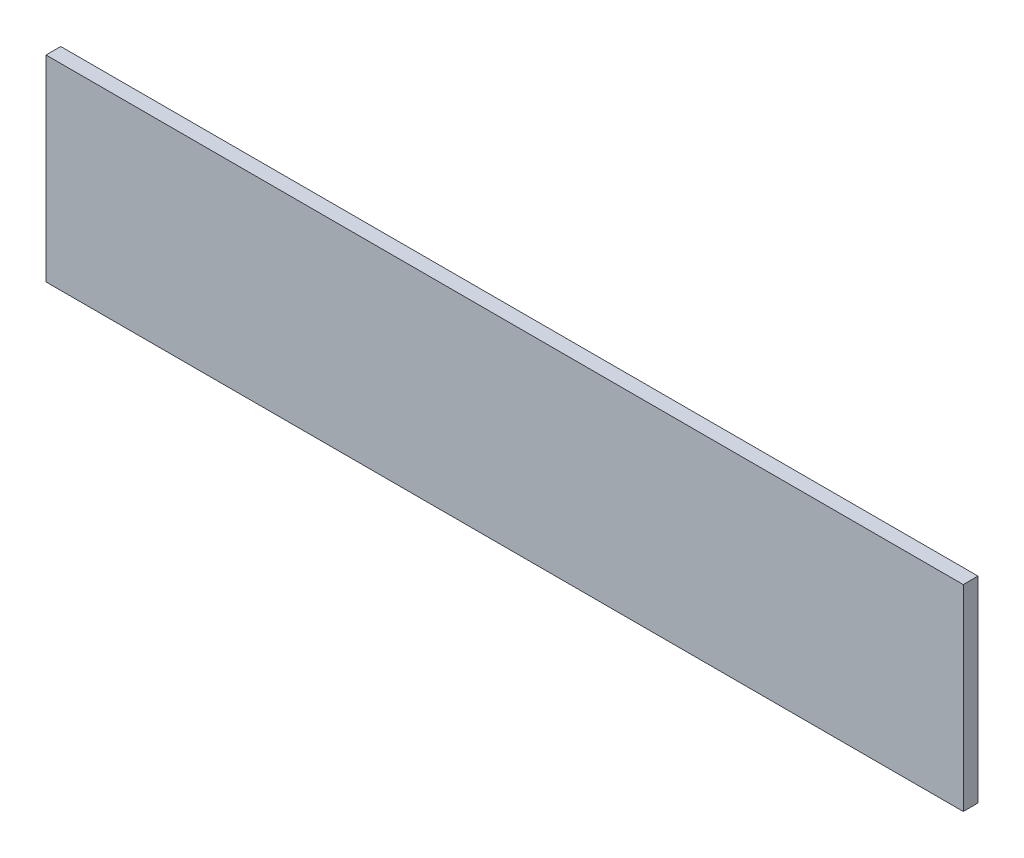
from build123d import *

# Parameters (mm, degrees)
SKETCH1_W           = 280
SKETCH1_H           = 60
BOSS_EXTRUDE1_DEPTH = 4.5


with BuildPart() as part:
    # Sketch1 → Boss-Extrude1 (new body)
    with BuildSketch(Plane.XY):
        Rectangle(SKETCH1_W, SKETCH1_H)
    extrude(amount=BOSS_EXTRUDE1_DEPTH)


solid = part.part
